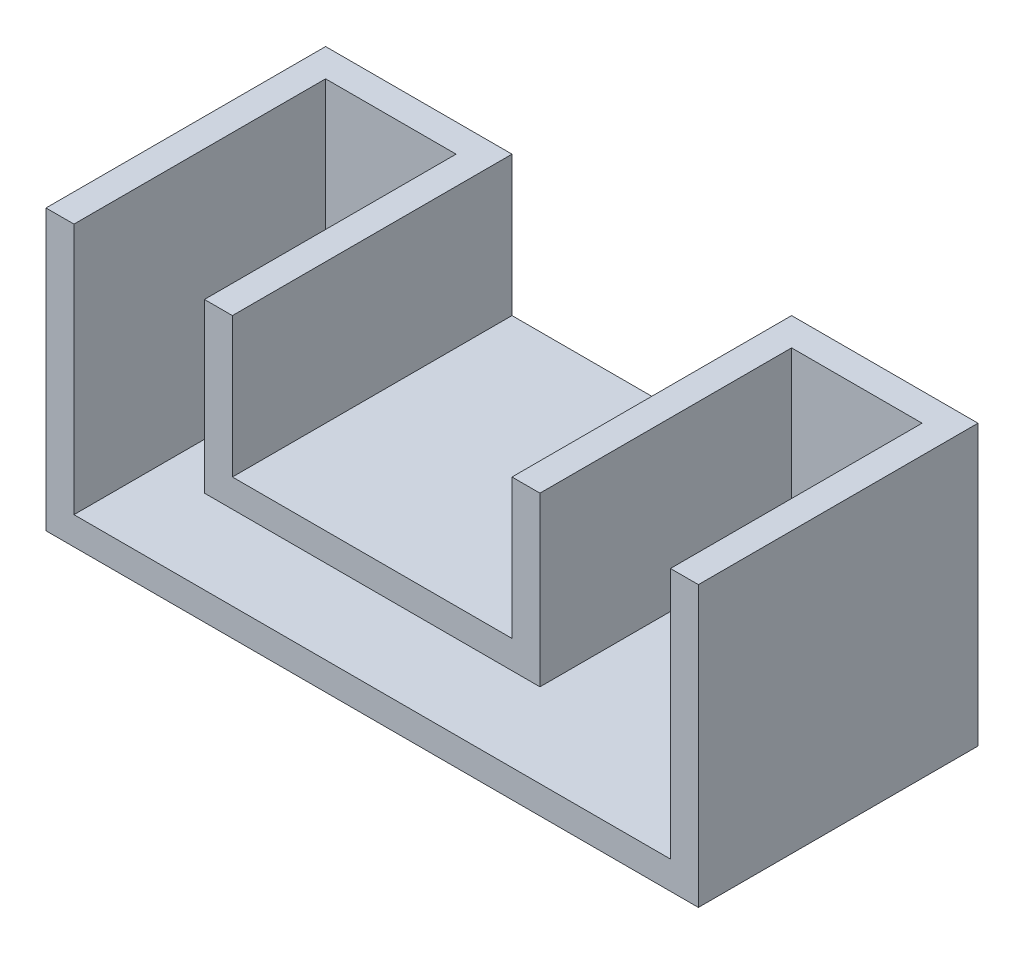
ISO-10303-21;
HEADER;
FILE_DESCRIPTION(('STEP AP214'),'2;1');
FILE_NAME('part.step','',(''),(''),'','','');
FILE_SCHEMA(('AUTOMOTIVE_DESIGN { 1 0 10303 214 1 1 1 1 }'));
ENDSEC;
DATA;
#1=APPLICATION_CONTEXT('core data for automotive mechanical design processes');
#2=APPLICATION_PROTOCOL_DEFINITION('international standard','automotive_design',2000,#1);
#3=PRODUCT_CONTEXT('',#1,'mechanical');
#4=PRODUCT('Part','Part','',(#3));
#5=PRODUCT_RELATED_PRODUCT_CATEGORY('part','',(#4));
#6=PRODUCT_DEFINITION_FORMATION('','',#4);
#7=PRODUCT_DEFINITION_CONTEXT('part definition',#1,'design');
#8=PRODUCT_DEFINITION('design','',#6,#7);
#9=PRODUCT_DEFINITION_SHAPE('','',#8);
#10=(LENGTH_UNIT() NAMED_UNIT(*) SI_UNIT(.MILLI.,.METRE.));
#11=(NAMED_UNIT(*) PLANE_ANGLE_UNIT() SI_UNIT($,.RADIAN.));
#12=(NAMED_UNIT(*) SI_UNIT($,.STERADIAN.) SOLID_ANGLE_UNIT());
#13=UNCERTAINTY_MEASURE_WITH_UNIT(LENGTH_MEASURE(1.E-05),#10,'distance_accuracy_value','');
#14=(GEOMETRIC_REPRESENTATION_CONTEXT(3) GLOBAL_UNCERTAINTY_ASSIGNED_CONTEXT((#13)) GLOBAL_UNIT_ASSIGNED_CONTEXT((#10,
#11,#12)) REPRESENTATION_CONTEXT('',''));
#15=CARTESIAN_POINT('',(0.,0.,0.));
#16=DIRECTION('',(0.,0.,1.));
#17=DIRECTION('',(1.,0.,0.));
#18=AXIS2_PLACEMENT_3D('',#15,#16,#17);
#19=CARTESIAN_POINT('',(0.,0.,15.));
#20=DIRECTION('',(0.,0.,-1.));
#21=DIRECTION('',(-1.,0.,0.));
#22=AXIS2_PLACEMENT_3D('',#19,#20,#21);
#23=PLANE('',#22);
#24=DIRECTION('',(0.,-1.,0.));
#25=VECTOR('',#24,1.);
#26=CARTESIAN_POINT('',(53.,0.,15.));
#27=LINE('',#26,#25);
#28=CARTESIAN_POINT('',(53.,30.,15.));
#29=VERTEX_POINT('',#28);
#30=CARTESIAN_POINT('',(53.,12.,15.));
#31=VERTEX_POINT('',#30);
#32=EDGE_CURVE('E196',#29,#31,#27,.T.);
#33=ORIENTED_EDGE('',*,*,#32,.F.);
#34=DIRECTION('',(-1.,0.,0.));
#35=VECTOR('',#34,1.);
#36=CARTESIAN_POINT('',(50.,30.,15.));
#37=LINE('',#36,#35);
#38=CARTESIAN_POINT('',(50.,30.,15.));
#39=VERTEX_POINT('',#38);
#40=EDGE_CURVE('E231',#29,#39,#37,.T.);
#41=ORIENTED_EDGE('',*,*,#40,.T.);
#42=DIRECTION('',(0.,-1.,0.));
#43=VECTOR('',#42,1.);
#44=CARTESIAN_POINT('',(50.,15.,15.));
#45=LINE('',#44,#43);
#46=CARTESIAN_POINT('',(50.,15.,15.));
#47=VERTEX_POINT('',#46);
#48=EDGE_CURVE('E235',#39,#47,#45,.T.);
#49=ORIENTED_EDGE('',*,*,#48,.T.);
#50=DIRECTION('',(-1.,0.,0.));
#51=VECTOR('',#50,1.);
#52=CARTESIAN_POINT('',(20.,15.,15.));
#53=LINE('',#52,#51);
#54=CARTESIAN_POINT('',(20.,15.,15.));
#55=VERTEX_POINT('',#54);
#56=EDGE_CURVE('E237',#47,#55,#53,.T.);
#57=ORIENTED_EDGE('',*,*,#56,.T.);
#58=DIRECTION('',(0.,1.,0.));
#59=VECTOR('',#58,1.);
#60=CARTESIAN_POINT('',(20.,30.,15.));
#61=LINE('',#60,#59);
#62=CARTESIAN_POINT('',(20.,30.,15.));
#63=VERTEX_POINT('',#62);
#64=EDGE_CURVE('E239',#55,#63,#61,.T.);
#65=ORIENTED_EDGE('',*,*,#64,.T.);
#66=DIRECTION('',(-1.,0.,0.));
#67=VECTOR('',#66,1.);
#68=CARTESIAN_POINT('',(0.,30.,15.));
#69=LINE('',#68,#67);
#70=CARTESIAN_POINT('',(17.,30.,15.));
#71=VERTEX_POINT('',#70);
#72=EDGE_CURVE('E242',#63,#71,#69,.T.);
#73=ORIENTED_EDGE('',*,*,#72,.T.);
#74=DIRECTION('',(0.,1.,0.));
#75=VECTOR('',#74,1.);
#76=CARTESIAN_POINT('',(17.,0.,15.));
#77=LINE('',#76,#75);
#78=CARTESIAN_POINT('',(17.,12.,15.));
#79=VERTEX_POINT('',#78);
#80=EDGE_CURVE('E204',#79,#71,#77,.T.);
#81=ORIENTED_EDGE('',*,*,#80,.F.);
#82=DIRECTION('',(-1.,0.,0.));
#83=VECTOR('',#82,1.);
#84=CARTESIAN_POINT('',(0.,12.,15.));
#85=LINE('',#84,#83);
#86=EDGE_CURVE('E202',#31,#79,#85,.T.);
#87=ORIENTED_EDGE('',*,*,#86,.F.);
#88=EDGE_LOOP('',(#33,#41,#49,#57,#65,#73,#81,#87));
#89=FACE_BOUND('',#88,.T.);
#90=ADVANCED_FACE('F33',(#89),#23,.F.);
#91=DIRECTION('',(0.,1.,0.));
#92=VECTOR('',#91,1.);
#93=CARTESIAN_POINT('',(67.,0.,15.));
#94=LINE('',#93,#92);
#95=CARTESIAN_POINT('',(67.,3.,15.));
#96=VERTEX_POINT('',#95);
#97=CARTESIAN_POINT('',(67.,30.,15.));
#98=VERTEX_POINT('',#97);
#99=EDGE_CURVE('E194',#96,#98,#94,.T.);
#100=ORIENTED_EDGE('',*,*,#99,.F.);
#101=DIRECTION('',(1.,0.,0.));
#102=VECTOR('',#101,1.);
#103=CARTESIAN_POINT('',(0.,3.,15.));
#104=LINE('',#103,#102);
#105=CARTESIAN_POINT('',(3.,3.,15.));
#106=VERTEX_POINT('',#105);
#107=EDGE_CURVE('E166',#106,#96,#104,.T.);
#108=ORIENTED_EDGE('',*,*,#107,.F.);
#109=DIRECTION('',(0.,-1.,0.));
#110=VECTOR('',#109,1.);
#111=CARTESIAN_POINT('',(3.,0.,15.));
#112=LINE('',#111,#110);
#113=CARTESIAN_POINT('',(3.,30.,15.));
#114=VERTEX_POINT('',#113);
#115=EDGE_CURVE('E175',#114,#106,#112,.T.);
#116=ORIENTED_EDGE('',*,*,#115,.F.);
#117=CARTESIAN_POINT('',(0.,30.,15.));
#118=VERTEX_POINT('',#117);
#119=EDGE_CURVE('E241',#114,#118,#69,.T.);
#120=ORIENTED_EDGE('',*,*,#119,.T.);
#121=DIRECTION('',(0.,-1.,0.));
#122=VECTOR('',#121,1.);
#123=CARTESIAN_POINT('',(0.,0.,15.));
#124=LINE('',#123,#122);
#125=CARTESIAN_POINT('',(0.,0.,15.));
#126=VERTEX_POINT('',#125);
#127=EDGE_CURVE('E56',#118,#126,#124,.T.);
#128=ORIENTED_EDGE('',*,*,#127,.T.);
#129=DIRECTION('',(1.,0.,0.));
#130=VECTOR('',#129,1.);
#131=CARTESIAN_POINT('',(70.,0.,15.));
#132=LINE('',#131,#130);
#133=CARTESIAN_POINT('',(70.,0.,15.));
#134=VERTEX_POINT('',#133);
#135=EDGE_CURVE('E227',#126,#134,#132,.T.);
#136=ORIENTED_EDGE('',*,*,#135,.T.);
#137=DIRECTION('',(0.,1.,0.));
#138=VECTOR('',#137,1.);
#139=CARTESIAN_POINT('',(70.,30.,15.));
#140=LINE('',#139,#138);
#141=CARTESIAN_POINT('',(70.,30.,15.));
#142=VERTEX_POINT('',#141);
#143=EDGE_CURVE('E229',#134,#142,#140,.T.);
#144=ORIENTED_EDGE('',*,*,#143,.T.);
#145=EDGE_CURVE('E232',#142,#98,#37,.T.);
#146=ORIENTED_EDGE('',*,*,#145,.T.);
#147=EDGE_LOOP('',(#100,#108,#116,#120,#128,#136,#144,#146));
#148=FACE_BOUND('',#147,.T.);
#149=ADVANCED_FACE('F310',(#148),#23,.F.);
#150=CARTESIAN_POINT('',(70.,0.,15.));
#151=DIRECTION('',(0.,1.,0.));
#152=DIRECTION('',(-1.,0.,0.));
#153=AXIS2_PLACEMENT_3D('',#150,#151,#152);
#154=PLANE('',#153);
#155=DIRECTION('',(1.,0.,0.));
#156=VECTOR('',#155,1.);
#157=CARTESIAN_POINT('',(70.,0.,-15.));
#158=LINE('',#157,#156);
#159=CARTESIAN_POINT('',(0.,0.,-15.));
#160=VERTEX_POINT('',#159);
#161=CARTESIAN_POINT('',(70.,0.,-15.));
#162=VERTEX_POINT('',#161);
#163=EDGE_CURVE('E167',#160,#162,#158,.T.);
#164=ORIENTED_EDGE('',*,*,#163,.T.);
#165=DIRECTION('',(0.,0.,-1.));
#166=VECTOR('',#165,1.);
#167=CARTESIAN_POINT('',(70.,0.,15.));
#168=LINE('',#167,#166);
#169=EDGE_CURVE('E11',#134,#162,#168,.T.);
#170=ORIENTED_EDGE('',*,*,#169,.F.);
#171=ORIENTED_EDGE('',*,*,#135,.F.);
#172=DIRECTION('',(0.,0.,-1.));
#173=VECTOR('',#172,1.);
#174=CARTESIAN_POINT('',(0.,0.,15.));
#175=LINE('',#174,#173);
#176=EDGE_CURVE('E246',#126,#160,#175,.T.);
#177=ORIENTED_EDGE('',*,*,#176,.T.);
#178=EDGE_LOOP('',(#164,#170,#171,#177));
#179=FACE_BOUND('',#178,.T.);
#180=ADVANCED_FACE('F35',(#179),#154,.F.);
#181=CARTESIAN_POINT('',(70.,30.,15.));
#182=DIRECTION('',(-1.,0.,0.));
#183=DIRECTION('',(0.,0.,1.));
#184=AXIS2_PLACEMENT_3D('',#181,#182,#183);
#185=PLANE('',#184);
#186=DIRECTION('',(0.,1.,0.));
#187=VECTOR('',#186,1.);
#188=CARTESIAN_POINT('',(70.,30.,-15.));
#189=LINE('',#188,#187);
#190=CARTESIAN_POINT('',(70.,30.,-15.));
#191=VERTEX_POINT('',#190);
#192=EDGE_CURVE('E213',#162,#191,#189,.T.);
#193=ORIENTED_EDGE('',*,*,#192,.T.);
#194=DIRECTION('',(0.,0.,-1.));
#195=VECTOR('',#194,1.);
#196=CARTESIAN_POINT('',(70.,30.,15.));
#197=LINE('',#196,#195);
#198=EDGE_CURVE('E41',#142,#191,#197,.T.);
#199=ORIENTED_EDGE('',*,*,#198,.F.);
#200=ORIENTED_EDGE('',*,*,#143,.F.);
#201=ORIENTED_EDGE('',*,*,#169,.T.);
#202=EDGE_LOOP('',(#193,#199,#200,#201));
#203=FACE_BOUND('',#202,.T.);
#204=ADVANCED_FACE('F313',(#203),#185,.F.);
#205=CARTESIAN_POINT('',(50.,30.,15.));
#206=DIRECTION('',(0.,-1.,0.));
#207=DIRECTION('',(0.,0.,-1.));
#208=AXIS2_PLACEMENT_3D('',#205,#206,#207);
#209=PLANE('',#208);
#210=ORIENTED_EDGE('',*,*,#40,.F.);
#211=DIRECTION('',(0.,0.,-1.));
#212=VECTOR('',#211,1.);
#213=CARTESIAN_POINT('',(53.,30.,15.));
#214=LINE('',#213,#212);
#215=CARTESIAN_POINT('',(53.,30.,-12.));
#216=VERTEX_POINT('',#215);
#217=EDGE_CURVE('E188',#29,#216,#214,.T.);
#218=ORIENTED_EDGE('',*,*,#217,.T.);
#219=DIRECTION('',(-1.,0.,0.));
#220=VECTOR('',#219,1.);
#221=CARTESIAN_POINT('',(0.,30.,-12.));
#222=LINE('',#221,#220);
#223=CARTESIAN_POINT('',(67.,30.,-12.));
#224=VERTEX_POINT('',#223);
#225=EDGE_CURVE('E158',#224,#216,#222,.T.);
#226=ORIENTED_EDGE('',*,*,#225,.F.);
#227=DIRECTION('',(0.,0.,-1.));
#228=VECTOR('',#227,1.);
#229=CARTESIAN_POINT('',(67.,30.,15.));
#230=LINE('',#229,#228);
#231=EDGE_CURVE('E154',#98,#224,#230,.T.);
#232=ORIENTED_EDGE('',*,*,#231,.F.);
#233=ORIENTED_EDGE('',*,*,#145,.F.);
#234=ORIENTED_EDGE('',*,*,#198,.T.);
#235=DIRECTION('',(-1.,0.,0.));
#236=VECTOR('',#235,1.);
#237=CARTESIAN_POINT('',(50.,30.,-15.));
#238=LINE('',#237,#236);
#239=CARTESIAN_POINT('',(50.,30.,-15.));
#240=VERTEX_POINT('',#239);
#241=EDGE_CURVE('E215',#191,#240,#238,.T.);
#242=ORIENTED_EDGE('',*,*,#241,.T.);
#243=DIRECTION('',(0.,0.,-1.));
#244=VECTOR('',#243,1.);
#245=CARTESIAN_POINT('',(50.,30.,15.));
#246=LINE('',#245,#244);
#247=EDGE_CURVE('E261',#39,#240,#246,.T.);
#248=ORIENTED_EDGE('',*,*,#247,.F.);
#249=EDGE_LOOP('',(#210,#218,#226,#232,#233,#234,#242,#248));
#250=FACE_BOUND('',#249,.T.);
#251=ADVANCED_FACE('F269',(#250),#209,.F.);
#252=CARTESIAN_POINT('',(50.,15.,15.));
#253=DIRECTION('',(1.,0.,0.));
#254=DIRECTION('',(0.,0.,-1.));
#255=AXIS2_PLACEMENT_3D('',#252,#253,#254);
#256=PLANE('',#255);
#257=DIRECTION('',(0.,-1.,0.));
#258=VECTOR('',#257,1.);
#259=CARTESIAN_POINT('',(50.,15.,-15.));
#260=LINE('',#259,#258);
#261=CARTESIAN_POINT('',(50.,15.,-15.));
#262=VERTEX_POINT('',#261);
#263=EDGE_CURVE('E217',#240,#262,#260,.T.);
#264=ORIENTED_EDGE('',*,*,#263,.T.);
#265=DIRECTION('',(0.,0.,-1.));
#266=VECTOR('',#265,1.);
#267=CARTESIAN_POINT('',(50.,15.,15.));
#268=LINE('',#267,#266);
#269=EDGE_CURVE('E258',#47,#262,#268,.T.);
#270=ORIENTED_EDGE('',*,*,#269,.F.);
#271=ORIENTED_EDGE('',*,*,#48,.F.);
#272=ORIENTED_EDGE('',*,*,#247,.T.);
#273=EDGE_LOOP('',(#264,#270,#271,#272));
#274=FACE_BOUND('',#273,.T.);
#275=ADVANCED_FACE('F280',(#274),#256,.F.);
#276=CARTESIAN_POINT('',(20.,15.,15.));
#277=DIRECTION('',(0.,-1.,0.));
#278=DIRECTION('',(0.,0.,-1.));
#279=AXIS2_PLACEMENT_3D('',#276,#277,#278);
#280=PLANE('',#279);
#281=DIRECTION('',(-1.,0.,0.));
#282=VECTOR('',#281,1.);
#283=CARTESIAN_POINT('',(20.,15.,-15.));
#284=LINE('',#283,#282);
#285=CARTESIAN_POINT('',(20.,15.,-15.));
#286=VERTEX_POINT('',#285);
#287=EDGE_CURVE('E219',#262,#286,#284,.T.);
#288=ORIENTED_EDGE('',*,*,#287,.T.);
#289=DIRECTION('',(0.,0.,-1.));
#290=VECTOR('',#289,1.);
#291=CARTESIAN_POINT('',(20.,15.,15.));
#292=LINE('',#291,#290);
#293=EDGE_CURVE('E255',#55,#286,#292,.T.);
#294=ORIENTED_EDGE('',*,*,#293,.F.);
#295=ORIENTED_EDGE('',*,*,#56,.F.);
#296=ORIENTED_EDGE('',*,*,#269,.T.);
#297=EDGE_LOOP('',(#288,#294,#295,#296));
#298=FACE_BOUND('',#297,.T.);
#299=ADVANCED_FACE('F284',(#298),#280,.F.);
#300=CARTESIAN_POINT('',(20.,30.,15.));
#301=DIRECTION('',(-1.,0.,0.));
#302=DIRECTION('',(0.,-1.,0.));
#303=AXIS2_PLACEMENT_3D('',#300,#301,#302);
#304=PLANE('',#303);
#305=DIRECTION('',(0.,1.,0.));
#306=VECTOR('',#305,1.);
#307=CARTESIAN_POINT('',(20.,30.,-15.));
#308=LINE('',#307,#306);
#309=CARTESIAN_POINT('',(20.,30.,-15.));
#310=VERTEX_POINT('',#309);
#311=EDGE_CURVE('E221',#286,#310,#308,.T.);
#312=ORIENTED_EDGE('',*,*,#311,.T.);
#313=DIRECTION('',(0.,0.,-1.));
#314=VECTOR('',#313,1.);
#315=CARTESIAN_POINT('',(20.,30.,15.));
#316=LINE('',#315,#314);
#317=EDGE_CURVE('E252',#63,#310,#316,.T.);
#318=ORIENTED_EDGE('',*,*,#317,.F.);
#319=ORIENTED_EDGE('',*,*,#64,.F.);
#320=ORIENTED_EDGE('',*,*,#293,.T.);
#321=EDGE_LOOP('',(#312,#318,#319,#320));
#322=FACE_BOUND('',#321,.T.);
#323=ADVANCED_FACE('F321',(#322),#304,.F.);
#324=CARTESIAN_POINT('',(0.,30.,15.));
#325=DIRECTION('',(0.,-1.,0.));
#326=DIRECTION('',(0.,0.,-1.));
#327=AXIS2_PLACEMENT_3D('',#324,#325,#326);
#328=PLANE('',#327);
#329=ORIENTED_EDGE('',*,*,#119,.F.);
#330=DIRECTION('',(0.,0.,-1.));
#331=VECTOR('',#330,1.);
#332=CARTESIAN_POINT('',(3.,30.,15.));
#333=LINE('',#332,#331);
#334=CARTESIAN_POINT('',(3.,30.,-12.));
#335=VERTEX_POINT('',#334);
#336=EDGE_CURVE('E48',#114,#335,#333,.T.);
#337=ORIENTED_EDGE('',*,*,#336,.T.);
#338=DIRECTION('',(-1.,0.,0.));
#339=VECTOR('',#338,1.);
#340=CARTESIAN_POINT('',(0.,30.,-12.));
#341=LINE('',#340,#339);
#342=CARTESIAN_POINT('',(17.,30.,-12.));
#343=VERTEX_POINT('',#342);
#344=EDGE_CURVE('E178',#343,#335,#341,.T.);
#345=ORIENTED_EDGE('',*,*,#344,.F.);
#346=DIRECTION('',(0.,0.,-1.));
#347=VECTOR('',#346,1.);
#348=CARTESIAN_POINT('',(17.,30.,15.));
#349=LINE('',#348,#347);
#350=EDGE_CURVE('E192',#71,#343,#349,.T.);
#351=ORIENTED_EDGE('',*,*,#350,.F.);
#352=ORIENTED_EDGE('',*,*,#72,.F.);
#353=ORIENTED_EDGE('',*,*,#317,.T.);
#354=DIRECTION('',(-1.,0.,0.));
#355=VECTOR('',#354,1.);
#356=CARTESIAN_POINT('',(0.,30.,-15.));
#357=LINE('',#356,#355);
#358=CARTESIAN_POINT('',(0.,30.,-15.));
#359=VERTEX_POINT('',#358);
#360=EDGE_CURVE('E223',#310,#359,#357,.T.);
#361=ORIENTED_EDGE('',*,*,#360,.T.);
#362=DIRECTION('',(0.,0.,-1.));
#363=VECTOR('',#362,1.);
#364=CARTESIAN_POINT('',(0.,30.,15.));
#365=LINE('',#364,#363);
#366=EDGE_CURVE('E249',#118,#359,#365,.T.);
#367=ORIENTED_EDGE('',*,*,#366,.F.);
#368=EDGE_LOOP('',(#329,#337,#345,#351,#352,#353,#361,#367));
#369=FACE_BOUND('',#368,.T.);
#370=ADVANCED_FACE('F308',(#369),#328,.F.);
#371=CARTESIAN_POINT('',(0.,0.,15.));
#372=DIRECTION('',(1.,0.,0.));
#373=DIRECTION('',(0.,0.,-1.));
#374=AXIS2_PLACEMENT_3D('',#371,#372,#373);
#375=PLANE('',#374);
#376=DIRECTION('',(0.,-1.,0.));
#377=VECTOR('',#376,1.);
#378=CARTESIAN_POINT('',(0.,0.,-15.));
#379=LINE('',#378,#377);
#380=EDGE_CURVE('E225',#359,#160,#379,.T.);
#381=ORIENTED_EDGE('',*,*,#380,.T.);
#382=ORIENTED_EDGE('',*,*,#176,.F.);
#383=ORIENTED_EDGE('',*,*,#127,.F.);
#384=ORIENTED_EDGE('',*,*,#366,.T.);
#385=EDGE_LOOP('',(#381,#382,#383,#384));
#386=FACE_BOUND('',#385,.T.);
#387=ADVANCED_FACE('F318',(#386),#375,.F.);
#388=CARTESIAN_POINT('',(0.,0.,-15.));
#389=DIRECTION('',(0.,0.,-1.));
#390=DIRECTION('',(-1.,0.,0.));
#391=AXIS2_PLACEMENT_3D('',#388,#389,#390);
#392=PLANE('',#391);
#393=ORIENTED_EDGE('',*,*,#163,.F.);
#394=ORIENTED_EDGE('',*,*,#380,.F.);
#395=ORIENTED_EDGE('',*,*,#360,.F.);
#396=ORIENTED_EDGE('',*,*,#311,.F.);
#397=ORIENTED_EDGE('',*,*,#287,.F.);
#398=ORIENTED_EDGE('',*,*,#263,.F.);
#399=ORIENTED_EDGE('',*,*,#241,.F.);
#400=ORIENTED_EDGE('',*,*,#192,.F.);
#401=EDGE_LOOP('',(#393,#394,#395,#396,#397,#398,#399,#400));
#402=FACE_BOUND('',#401,.T.);
#403=ADVANCED_FACE('F275',(#402),#392,.T.);
#404=CARTESIAN_POINT('',(70.,3.,15.));
#405=DIRECTION('',(0.,1.,0.));
#406=DIRECTION('',(-1.,0.,0.));
#407=AXIS2_PLACEMENT_3D('',#404,#405,#406);
#408=PLANE('',#407);
#409=DIRECTION('',(1.,0.,0.));
#410=VECTOR('',#409,1.);
#411=CARTESIAN_POINT('',(0.,3.,-12.));
#412=LINE('',#411,#410);
#413=CARTESIAN_POINT('',(3.,3.,-12.));
#414=VERTEX_POINT('',#413);
#415=CARTESIAN_POINT('',(67.,3.,-12.));
#416=VERTEX_POINT('',#415);
#417=EDGE_CURVE('E159',#414,#416,#412,.T.);
#418=ORIENTED_EDGE('',*,*,#417,.F.);
#419=DIRECTION('',(0.,0.,-1.));
#420=VECTOR('',#419,1.);
#421=CARTESIAN_POINT('',(3.,3.,15.));
#422=LINE('',#421,#420);
#423=EDGE_CURVE('E174',#106,#414,#422,.T.);
#424=ORIENTED_EDGE('',*,*,#423,.F.);
#425=ORIENTED_EDGE('',*,*,#107,.T.);
#426=DIRECTION('',(0.,0.,-1.));
#427=VECTOR('',#426,1.);
#428=CARTESIAN_POINT('',(67.,3.,15.));
#429=LINE('',#428,#427);
#430=EDGE_CURVE('E151',#96,#416,#429,.T.);
#431=ORIENTED_EDGE('',*,*,#430,.T.);
#432=EDGE_LOOP('',(#418,#424,#425,#431));
#433=FACE_BOUND('',#432,.T.);
#434=ADVANCED_FACE('F163',(#433),#408,.T.);
#435=CARTESIAN_POINT('',(67.,30.,15.));
#436=DIRECTION('',(-1.,0.,0.));
#437=DIRECTION('',(0.,0.,1.));
#438=AXIS2_PLACEMENT_3D('',#435,#436,#437);
#439=PLANE('',#438);
#440=DIRECTION('',(0.,1.,0.));
#441=VECTOR('',#440,1.);
#442=CARTESIAN_POINT('',(67.,0.,-12.));
#443=LINE('',#442,#441);
#444=EDGE_CURVE('E148',#416,#224,#443,.T.);
#445=ORIENTED_EDGE('',*,*,#444,.F.);
#446=ORIENTED_EDGE('',*,*,#430,.F.);
#447=ORIENTED_EDGE('',*,*,#99,.T.);
#448=ORIENTED_EDGE('',*,*,#231,.T.);
#449=EDGE_LOOP('',(#445,#446,#447,#448));
#450=FACE_BOUND('',#449,.T.);
#451=ADVANCED_FACE('F150',(#450),#439,.T.);
#452=CARTESIAN_POINT('',(53.,15.,15.));
#453=DIRECTION('',(1.,0.,0.));
#454=DIRECTION('',(0.,0.,-1.));
#455=AXIS2_PLACEMENT_3D('',#452,#453,#454);
#456=PLANE('',#455);
#457=DIRECTION('',(0.,-1.,0.));
#458=VECTOR('',#457,1.);
#459=CARTESIAN_POINT('',(53.,0.,-12.));
#460=LINE('',#459,#458);
#461=CARTESIAN_POINT('',(53.,12.,-12.));
#462=VERTEX_POINT('',#461);
#463=EDGE_CURVE('E183',#216,#462,#460,.T.);
#464=ORIENTED_EDGE('',*,*,#463,.F.);
#465=ORIENTED_EDGE('',*,*,#217,.F.);
#466=ORIENTED_EDGE('',*,*,#32,.T.);
#467=DIRECTION('',(0.,0.,-1.));
#468=VECTOR('',#467,1.);
#469=CARTESIAN_POINT('',(53.,12.,15.));
#470=LINE('',#469,#468);
#471=EDGE_CURVE('E185',#31,#462,#470,.T.);
#472=ORIENTED_EDGE('',*,*,#471,.T.);
#473=EDGE_LOOP('',(#464,#465,#466,#472));
#474=FACE_BOUND('',#473,.T.);
#475=ADVANCED_FACE('F293',(#474),#456,.T.);
#476=CARTESIAN_POINT('',(20.,12.,15.));
#477=DIRECTION('',(0.,-1.,0.));
#478=DIRECTION('',(0.,0.,-1.));
#479=AXIS2_PLACEMENT_3D('',#476,#477,#478);
#480=PLANE('',#479);
#481=DIRECTION('',(-1.,0.,0.));
#482=VECTOR('',#481,1.);
#483=CARTESIAN_POINT('',(0.,12.,-12.));
#484=LINE('',#483,#482);
#485=CARTESIAN_POINT('',(17.,12.,-12.));
#486=VERTEX_POINT('',#485);
#487=EDGE_CURVE('E181',#462,#486,#484,.T.);
#488=ORIENTED_EDGE('',*,*,#487,.F.);
#489=ORIENTED_EDGE('',*,*,#471,.F.);
#490=ORIENTED_EDGE('',*,*,#86,.T.);
#491=DIRECTION('',(0.,0.,-1.));
#492=VECTOR('',#491,1.);
#493=CARTESIAN_POINT('',(17.,12.,15.));
#494=LINE('',#493,#492);
#495=EDGE_CURVE('E189',#79,#486,#494,.T.);
#496=ORIENTED_EDGE('',*,*,#495,.T.);
#497=EDGE_LOOP('',(#488,#489,#490,#496));
#498=FACE_BOUND('',#497,.T.);
#499=ADVANCED_FACE('F299',(#498),#480,.T.);
#500=CARTESIAN_POINT('',(17.,30.,15.));
#501=DIRECTION('',(-1.,0.,0.));
#502=DIRECTION('',(0.,-1.,0.));
#503=AXIS2_PLACEMENT_3D('',#500,#501,#502);
#504=PLANE('',#503);
#505=DIRECTION('',(0.,1.,0.));
#506=VECTOR('',#505,1.);
#507=CARTESIAN_POINT('',(17.,0.,-12.));
#508=LINE('',#507,#506);
#509=EDGE_CURVE('E179',#486,#343,#508,.T.);
#510=ORIENTED_EDGE('',*,*,#509,.F.);
#511=ORIENTED_EDGE('',*,*,#495,.F.);
#512=ORIENTED_EDGE('',*,*,#80,.T.);
#513=ORIENTED_EDGE('',*,*,#350,.T.);
#514=EDGE_LOOP('',(#510,#511,#512,#513));
#515=FACE_BOUND('',#514,.T.);
#516=ADVANCED_FACE('F302',(#515),#504,.T.);
#517=CARTESIAN_POINT('',(3.,0.,15.));
#518=DIRECTION('',(1.,0.,0.));
#519=DIRECTION('',(0.,0.,-1.));
#520=AXIS2_PLACEMENT_3D('',#517,#518,#519);
#521=PLANE('',#520);
#522=DIRECTION('',(0.,-1.,0.));
#523=VECTOR('',#522,1.);
#524=CARTESIAN_POINT('',(3.,0.,-12.));
#525=LINE('',#524,#523);
#526=EDGE_CURVE('E170',#335,#414,#525,.T.);
#527=ORIENTED_EDGE('',*,*,#526,.F.);
#528=ORIENTED_EDGE('',*,*,#336,.F.);
#529=ORIENTED_EDGE('',*,*,#115,.T.);
#530=ORIENTED_EDGE('',*,*,#423,.T.);
#531=EDGE_LOOP('',(#527,#528,#529,#530));
#532=FACE_BOUND('',#531,.T.);
#533=ADVANCED_FACE('F309',(#532),#521,.T.);
#534=CARTESIAN_POINT('',(0.,0.,-12.));
#535=DIRECTION('',(0.,0.,-1.));
#536=DIRECTION('',(-1.,0.,0.));
#537=AXIS2_PLACEMENT_3D('',#534,#535,#536);
#538=PLANE('',#537);
#539=ORIENTED_EDGE('',*,*,#417,.T.);
#540=ORIENTED_EDGE('',*,*,#444,.T.);
#541=ORIENTED_EDGE('',*,*,#225,.T.);
#542=ORIENTED_EDGE('',*,*,#463,.T.);
#543=ORIENTED_EDGE('',*,*,#487,.T.);
#544=ORIENTED_EDGE('',*,*,#509,.T.);
#545=ORIENTED_EDGE('',*,*,#344,.T.);
#546=ORIENTED_EDGE('',*,*,#526,.T.);
#547=EDGE_LOOP('',(#539,#540,#541,#542,#543,#544,#545,#546));
#548=FACE_BOUND('',#547,.T.);
#549=ADVANCED_FACE('F169',(#548),#538,.F.);
#550=CLOSED_SHELL('',(#90,#149,#180,#204,#251,#275,#299,#323,#370,#387,#403,#434,#451,#475,#499,
#516,#533,#549));
#551=MANIFOLD_SOLID_BREP('B2',#550);
#552=ADVANCED_BREP_SHAPE_REPRESENTATION('',(#18,#551),#14);
#553=SHAPE_DEFINITION_REPRESENTATION(#9,#552);
ENDSEC;
END-ISO-10303-21;
